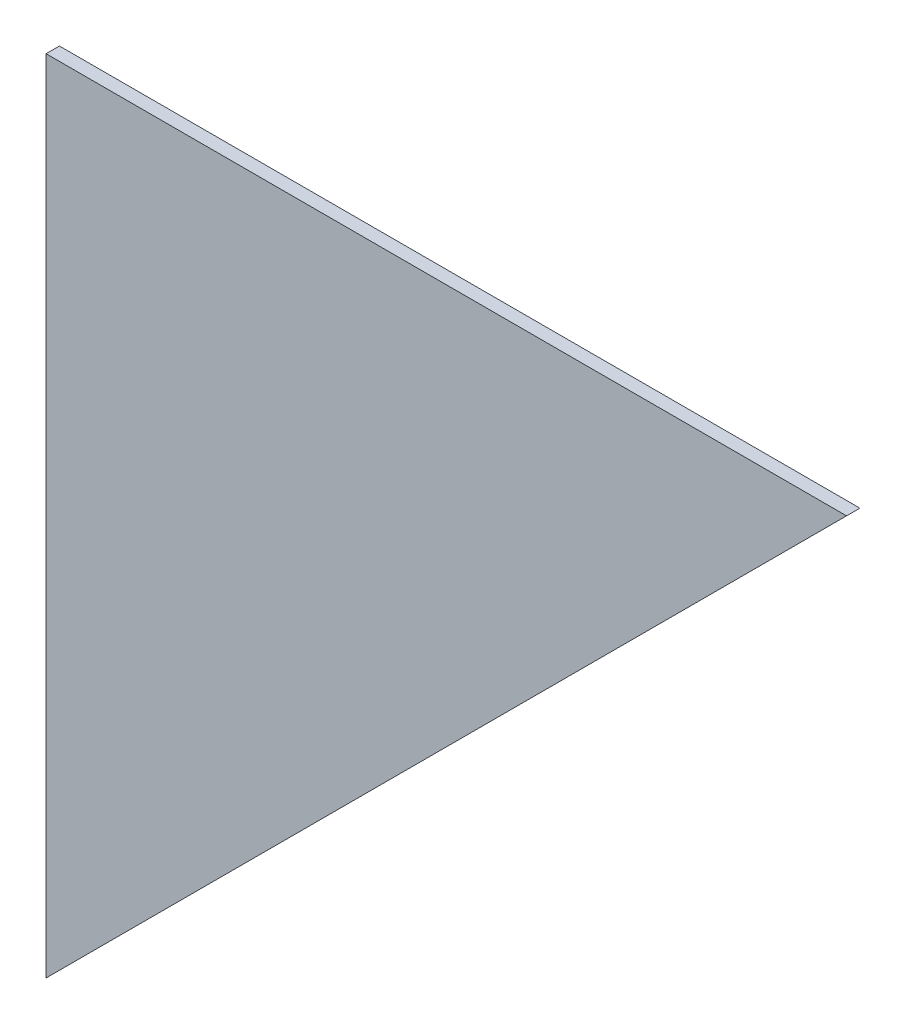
from build123d import *

# Parameters (mm, degrees)
BOSS_EXTRUDE1_DEPTH = 2.54


with BuildPart() as part:
    # Sketch1 → Boss-Extrude1 (new body)
    with BuildSketch(Plane.XY):
        Polygon((0, 0), (152.4, 0), (0, -152.4), align=None)
    extrude(amount=BOSS_EXTRUDE1_DEPTH)


solid = part.part
